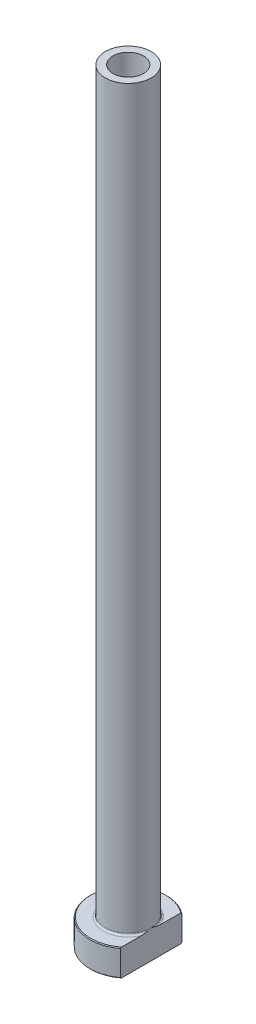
ISO-10303-21;
HEADER;
FILE_DESCRIPTION(('STEP AP214'),'2;1');
FILE_NAME('part.step','',(''),(''),'','','');
FILE_SCHEMA(('AUTOMOTIVE_DESIGN { 1 0 10303 214 1 1 1 1 }'));
ENDSEC;
DATA;
#1=APPLICATION_CONTEXT('core data for automotive mechanical design processes');
#2=APPLICATION_PROTOCOL_DEFINITION('international standard','automotive_design',2000,#1);
#3=PRODUCT_CONTEXT('',#1,'mechanical');
#4=PRODUCT('Part','Part','',(#3));
#5=PRODUCT_RELATED_PRODUCT_CATEGORY('part','',(#4));
#6=PRODUCT_DEFINITION_FORMATION('','',#4);
#7=PRODUCT_DEFINITION_CONTEXT('part definition',#1,'design');
#8=PRODUCT_DEFINITION('design','',#6,#7);
#9=PRODUCT_DEFINITION_SHAPE('','',#8);
#10=(LENGTH_UNIT() NAMED_UNIT(*) SI_UNIT(.MILLI.,.METRE.));
#11=(NAMED_UNIT(*) PLANE_ANGLE_UNIT() SI_UNIT($,.RADIAN.));
#12=(NAMED_UNIT(*) SI_UNIT($,.STERADIAN.) SOLID_ANGLE_UNIT());
#13=UNCERTAINTY_MEASURE_WITH_UNIT(LENGTH_MEASURE(1.E-05),#10,'distance_accuracy_value','');
#14=(GEOMETRIC_REPRESENTATION_CONTEXT(3) GLOBAL_UNCERTAINTY_ASSIGNED_CONTEXT((#13)) GLOBAL_UNIT_ASSIGNED_CONTEXT((#10,
#11,#12)) REPRESENTATION_CONTEXT('',''));
#15=CARTESIAN_POINT('',(0.,0.,0.));
#16=DIRECTION('',(0.,0.,1.));
#17=DIRECTION('',(1.,0.,0.));
#18=AXIS2_PLACEMENT_3D('',#15,#16,#17);
#19=CARTESIAN_POINT('',(0.,92.1876809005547,0.));
#20=DIRECTION('',(0.,1.,0.));
#21=DIRECTION('',(0.,0.,1.));
#22=AXIS2_PLACEMENT_3D('',#19,#20,#21);
#23=CYLINDRICAL_SURFACE('',#22,4.);
#24=CARTESIAN_POINT('',(0.,200.,0.));
#25=DIRECTION('',(0.,1.,0.));
#26=DIRECTION('',(0.,0.,1.));
#27=AXIS2_PLACEMENT_3D('',#24,#25,#26);
#28=CIRCLE('',#27,4.);
#29=CARTESIAN_POINT('',(0.,200.,4.));
#30=VERTEX_POINT('',#29);
#31=EDGE_CURVE('E167',#30,#30,#28,.T.);
#32=ORIENTED_EDGE('',*,*,#31,.T.);
#33=EDGE_LOOP('',(#32));
#34=FACE_BOUND('',#33,.T.);
#35=CARTESIAN_POINT('',(0.,155.,0.));
#36=DIRECTION('',(0.,1.,0.));
#37=DIRECTION('',(0.,0.,1.));
#38=AXIS2_PLACEMENT_3D('',#35,#36,#37);
#39=CIRCLE('',#38,4.);
#40=CARTESIAN_POINT('',(0.,155.,4.));
#41=VERTEX_POINT('',#40);
#42=EDGE_CURVE('E170',#41,#41,#39,.T.);
#43=ORIENTED_EDGE('',*,*,#42,.F.);
#44=EDGE_LOOP('',(#43));
#45=FACE_BOUND('',#44,.T.);
#46=ADVANCED_FACE('F32',(#34,#45),#23,.F.);
#47=CARTESIAN_POINT('',(-4.,200.,0.));
#48=DIRECTION('',(0.,1.,0.));
#49=DIRECTION('',(0.,0.,1.));
#50=AXIS2_PLACEMENT_3D('',#47,#48,#49);
#51=PLANE('',#50);
#52=CARTESIAN_POINT('',(0.,200.,0.));
#53=DIRECTION('',(0.,1.,0.));
#54=DIRECTION('',(0.,0.,1.));
#55=AXIS2_PLACEMENT_3D('',#52,#53,#54);
#56=CIRCLE('',#55,6.00000000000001);
#57=CARTESIAN_POINT('',(0.,200.,6.00000000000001));
#58=VERTEX_POINT('',#57);
#59=EDGE_CURVE('E174',#58,#58,#56,.T.);
#60=ORIENTED_EDGE('',*,*,#59,.T.);
#61=EDGE_LOOP('',(#60));
#62=FACE_BOUND('',#61,.T.);
#63=ORIENTED_EDGE('',*,*,#31,.F.);
#64=EDGE_LOOP('',(#63));
#65=FACE_BOUND('',#64,.T.);
#66=ADVANCED_FACE('F157',(#62,#65),#51,.T.);
#67=CARTESIAN_POINT('',(0.,92.1876809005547,0.));
#68=DIRECTION('',(0.,1.,0.));
#69=DIRECTION('',(0.,0.,1.));
#70=AXIS2_PLACEMENT_3D('',#67,#68,#69);
#71=CYLINDRICAL_SURFACE('',#70,6.);
#72=CARTESIAN_POINT('',(0.,7.50000000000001,0.));
#73=DIRECTION('',(0.,1.,0.));
#74=DIRECTION('',(0.,0.,1.));
#75=AXIS2_PLACEMENT_3D('',#72,#73,#74);
#76=CIRCLE('',#75,6.);
#77=CARTESIAN_POINT('',(6.,7.50000000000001,0.));
#78=VERTEX_POINT('',#77);
#79=EDGE_CURVE('E180',#78,#78,#76,.T.);
#80=ORIENTED_EDGE('',*,*,#79,.T.);
#81=EDGE_LOOP('',(#80));
#82=FACE_BOUND('',#81,.T.);
#83=ORIENTED_EDGE('',*,*,#59,.F.);
#84=EDGE_LOOP('',(#83));
#85=FACE_BOUND('',#84,.T.);
#86=ADVANCED_FACE('F162',(#82,#85),#71,.T.);
#87=CARTESIAN_POINT('',(-5.99999999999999,7.,0.));
#88=DIRECTION('',(0.,1.,0.));
#89=DIRECTION('',(0.,0.,1.));
#90=AXIS2_PLACEMENT_3D('',#87,#88,#89);
#91=PLANE('',#90);
#92=DIRECTION('',(0.,0.,1.));
#93=VECTOR('',#92,1.);
#94=CARTESIAN_POINT('',(6.,7.,0.));
#95=LINE('',#94,#93);
#96=CARTESIAN_POINT('',(6.,7.,-7.74854825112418));
#97=VERTEX_POINT('',#96);
#98=CARTESIAN_POINT('',(6.,7.,-2.50000000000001));
#99=VERTEX_POINT('',#98);
#100=EDGE_CURVE('E54',#97,#99,#95,.T.);
#101=ORIENTED_EDGE('',*,*,#100,.F.);
#102=CARTESIAN_POINT('',(0.,7.,0.));
#103=DIRECTION('',(0.,1.,0.));
#104=DIRECTION('',(0.,0.,1.));
#105=AXIS2_PLACEMENT_3D('',#102,#103,#104);
#106=CIRCLE('',#105,9.79999999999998);
#107=CARTESIAN_POINT('',(5.99999999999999,7.,7.74854825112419));
#108=VERTEX_POINT('',#107);
#109=EDGE_CURVE('E186',#97,#108,#106,.T.);
#110=ORIENTED_EDGE('',*,*,#109,.T.);
#111=CARTESIAN_POINT('',(6.,7.,2.50000000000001));
#112=VERTEX_POINT('',#111);
#113=EDGE_CURVE('E134',#112,#108,#95,.T.);
#114=ORIENTED_EDGE('',*,*,#113,.F.);
#115=CARTESIAN_POINT('',(0.,7.,0.));
#116=DIRECTION('',(0.,1.,0.));
#117=DIRECTION('',(0.,0.,1.));
#118=AXIS2_PLACEMENT_3D('',#115,#116,#117);
#119=CIRCLE('',#118,6.5);
#120=EDGE_CURVE('E183',#112,#99,#119,.F.);
#121=ORIENTED_EDGE('',*,*,#120,.T.);
#122=EDGE_LOOP('',(#101,#110,#114,#121));
#123=FACE_BOUND('',#122,.T.);
#124=ADVANCED_FACE('F197',(#123),#91,.T.);
#125=CARTESIAN_POINT('',(0.,92.1876809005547,0.));
#126=DIRECTION('',(0.,1.,0.));
#127=DIRECTION('',(0.,0.,1.));
#128=AXIS2_PLACEMENT_3D('',#125,#126,#127);
#129=CYLINDRICAL_SURFACE('',#128,9.99999999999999);
#130=DIRECTION('',(0.,-1.,0.));
#131=VECTOR('',#130,1.);
#132=CARTESIAN_POINT('',(5.99999999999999,200.,7.99999999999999));
#133=LINE('',#132,#131);
#134=CARTESIAN_POINT('',(5.99999999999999,6.8,7.99999999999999));
#135=VERTEX_POINT('',#134);
#136=CARTESIAN_POINT('',(5.99999999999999,0.200000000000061,7.99999999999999));
#137=VERTEX_POINT('',#136);
#138=EDGE_CURVE('E82',#135,#137,#133,.T.);
#139=ORIENTED_EDGE('',*,*,#138,.F.);
#140=CARTESIAN_POINT('',(0.,6.8,0.));
#141=DIRECTION('',(0.,1.,0.));
#142=DIRECTION('',(0.,0.,1.));
#143=AXIS2_PLACEMENT_3D('',#140,#141,#142);
#144=CIRCLE('',#143,9.99999999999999);
#145=CARTESIAN_POINT('',(6.,6.8,-7.99999999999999));
#146=VERTEX_POINT('',#145);
#147=EDGE_CURVE('E95',#135,#146,#144,.F.);
#148=ORIENTED_EDGE('',*,*,#147,.T.);
#149=DIRECTION('',(0.,-1.,0.));
#150=VECTOR('',#149,1.);
#151=CARTESIAN_POINT('',(6.,200.,-7.99999999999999));
#152=LINE('',#151,#150);
#153=CARTESIAN_POINT('',(6.,0.200000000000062,-7.99999999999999));
#154=VERTEX_POINT('',#153);
#155=EDGE_CURVE('E192',#146,#154,#152,.T.);
#156=ORIENTED_EDGE('',*,*,#155,.T.);
#157=CARTESIAN_POINT('',(0.,0.200000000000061,0.));
#158=DIRECTION('',(0.,-1.,0.));
#159=DIRECTION('',(0.,0.,-1.));
#160=AXIS2_PLACEMENT_3D('',#157,#158,#159);
#161=CIRCLE('',#160,9.99999999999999);
#162=EDGE_CURVE('E98',#154,#137,#161,.F.);
#163=ORIENTED_EDGE('',*,*,#162,.T.);
#164=EDGE_LOOP('',(#139,#148,#156,#163));
#165=FACE_BOUND('',#164,.T.);
#166=ADVANCED_FACE('F190',(#165),#129,.T.);
#167=CARTESIAN_POINT('',(-9.99999999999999,0.,0.));
#168=DIRECTION('',(0.,-1.,0.));
#169=DIRECTION('',(0.,0.,-1.));
#170=AXIS2_PLACEMENT_3D('',#167,#168,#169);
#171=PLANE('',#170);
#172=CARTESIAN_POINT('',(0.,0.,0.));
#173=DIRECTION('',(0.,-1.,0.));
#174=DIRECTION('',(0.,0.,-1.));
#175=AXIS2_PLACEMENT_3D('',#172,#173,#174);
#176=CIRCLE('',#175,4.75);
#177=CARTESIAN_POINT('',(0.,0.,-4.75));
#178=VERTEX_POINT('',#177);
#179=EDGE_CURVE('E40',#178,#178,#176,.F.);
#180=ORIENTED_EDGE('',*,*,#179,.T.);
#181=EDGE_LOOP('',(#180));
#182=FACE_BOUND('',#181,.T.);
#183=DIRECTION('',(0.,0.,-1.));
#184=VECTOR('',#183,1.);
#185=CARTESIAN_POINT('',(5.99999999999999,0.,7.99999999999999));
#186=LINE('',#185,#184);
#187=CARTESIAN_POINT('',(5.99999999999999,0.,7.74854825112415));
#188=VERTEX_POINT('',#187);
#189=CARTESIAN_POINT('',(6.,0.,-7.74854825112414));
#190=VERTEX_POINT('',#189);
#191=EDGE_CURVE('E47',#188,#190,#186,.T.);
#192=ORIENTED_EDGE('',*,*,#191,.F.);
#193=CARTESIAN_POINT('',(0.,0.,0.));
#194=DIRECTION('',(0.,-1.,0.));
#195=DIRECTION('',(0.,0.,-1.));
#196=AXIS2_PLACEMENT_3D('',#193,#194,#195);
#197=CIRCLE('',#196,9.79999999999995);
#198=EDGE_CURVE('E92',#188,#190,#197,.T.);
#199=ORIENTED_EDGE('',*,*,#198,.T.);
#200=EDGE_LOOP('',(#192,#199));
#201=FACE_BOUND('',#200,.T.);
#202=ADVANCED_FACE('F91',(#182,#201),#171,.T.);
#203=CARTESIAN_POINT('',(0.,92.1876809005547,0.));
#204=DIRECTION('',(0.,1.,0.));
#205=DIRECTION('',(0.,0.,1.));
#206=AXIS2_PLACEMENT_3D('',#203,#204,#205);
#207=CYLINDRICAL_SURFACE('',#206,4.25);
#208=CARTESIAN_POINT('',(0.,0.500000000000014,0.));
#209=DIRECTION('',(0.,-1.,0.));
#210=DIRECTION('',(0.,0.,-1.));
#211=AXIS2_PLACEMENT_3D('',#208,#209,#210);
#212=CIRCLE('',#211,4.25);
#213=CARTESIAN_POINT('',(0.,0.500000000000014,-4.25));
#214=VERTEX_POINT('',#213);
#215=EDGE_CURVE('E11',#214,#214,#212,.T.);
#216=ORIENTED_EDGE('',*,*,#215,.T.);
#217=EDGE_LOOP('',(#216));
#218=FACE_BOUND('',#217,.T.);
#219=CARTESIAN_POINT('',(0.,143.,0.));
#220=DIRECTION('',(0.,1.,0.));
#221=DIRECTION('',(0.,0.,1.));
#222=AXIS2_PLACEMENT_3D('',#219,#220,#221);
#223=CIRCLE('',#222,4.25000000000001);
#224=CARTESIAN_POINT('',(0.,143.,4.25000000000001));
#225=VERTEX_POINT('',#224);
#226=EDGE_CURVE('E172',#225,#225,#223,.T.);
#227=ORIENTED_EDGE('',*,*,#226,.T.);
#228=EDGE_LOOP('',(#227));
#229=FACE_BOUND('',#228,.T.);
#230=ADVANCED_FACE('F215',(#218,#229),#207,.F.);
#231=CARTESIAN_POINT('',(0.,143.,0.));
#232=DIRECTION('',(0.,-1.,0.));
#233=DIRECTION('',(0.,0.,-1.));
#234=AXIS2_PLACEMENT_3D('',#231,#232,#233);
#235=CONICAL_SURFACE('',#234,4.25000000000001,0.0208303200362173);
#236=ORIENTED_EDGE('',*,*,#42,.T.);
#237=EDGE_LOOP('',(#236));
#238=FACE_BOUND('',#237,.T.);
#239=ORIENTED_EDGE('',*,*,#226,.F.);
#240=EDGE_LOOP('',(#239));
#241=FACE_BOUND('',#240,.T.);
#242=ADVANCED_FACE('F111',(#238,#241),#235,.F.);
#243=CARTESIAN_POINT('',(0.,7.50000000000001,0.));
#244=DIRECTION('',(0.,1.,0.));
#245=DIRECTION('',(0.,0.,1.));
#246=AXIS2_PLACEMENT_3D('',#243,#244,#245);
#247=TOROIDAL_SURFACE('',#246,6.5,0.5);
#248=ORIENTED_EDGE('',*,*,#120,.F.);
#249=CARTESIAN_POINT('',(6.,7.50000000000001,0.));
#250=CARTESIAN_POINT('',(6.,7.50000080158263,6.70445881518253E-11));
#251=CARTESIAN_POINT('',(6.,7.50000160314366,2.62462733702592E-07));
#252=CARTESIAN_POINT('',(6.,7.50000311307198,1.01907203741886E-06));
#253=CARTESIAN_POINT('',(6.,7.50000381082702,1.52837948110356E-06));
#254=CARTESIAN_POINT('',(6.,7.50000523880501,2.74467641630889E-06));
#255=CARTESIAN_POINT('',(6.,7.50000595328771,3.4706675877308E-06));
#256=CARTESIAN_POINT('',(6.,7.50000725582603,4.99336222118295E-06));
#257=CARTESIAN_POINT('',(6.,7.50000784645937,5.7880016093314E-06));
#258=CARTESIAN_POINT('',(6.,7.50000997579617,8.79661648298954E-06));
#259=CARTESIAN_POINT('',(6.,7.50001139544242,1.10980680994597E-05));
#260=CARTESIAN_POINT('',(6.,7.50001378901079,1.57116103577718E-05));
#261=CARTESIAN_POINT('',(6.,7.50001478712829,1.8011745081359E-05));
#262=CARTESIAN_POINT('',(6.,7.50001885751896,2.75423852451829E-05));
#263=CARTESIAN_POINT('',(6.,7.50002181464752,3.48285100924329E-05));
#264=CARTESIAN_POINT('',(6.,7.50002628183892,4.87408421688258E-05));
#265=CARTESIAN_POINT('',(6.,7.50002793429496,5.53214404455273E-05));
#266=CARTESIAN_POINT('',(6.,7.50003978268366,0.000103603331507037));
#267=CARTESIAN_POINT('',(6.,7.50004857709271,0.00014557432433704));
#268=CARTESIAN_POINT('',(6.,7.50008704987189,0.000310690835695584));
#269=CARTESIAN_POINT('',(6.,7.5001239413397,0.000432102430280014));
#270=CARTESIAN_POINT('',(5.99999999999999,7.50026686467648,0.000911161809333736));
#271=CARTESIAN_POINT('',(6.,7.50036807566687,0.00126981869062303));
#272=CARTESIAN_POINT('',(6.,7.50077195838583,0.00268961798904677));
#273=CARTESIAN_POINT('',(6.,7.50108058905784,0.00374948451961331));
#274=CARTESIAN_POINT('',(5.99999999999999,7.502363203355,0.00816658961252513));
#275=CARTESIAN_POINT('',(6.,7.50332976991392,0.0115254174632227));
#276=CARTESIAN_POINT('',(6.,7.51709821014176,0.0593544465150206));
#277=CARTESIAN_POINT('',(6.,7.52995465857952,0.103813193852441));
#278=CARTESIAN_POINT('',(5.99999999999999,7.55506029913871,0.190977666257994));
#279=CARTESIAN_POINT('',(6.,7.56731321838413,0.233682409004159));
#280=CARTESIAN_POINT('',(6.,7.59325665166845,0.324512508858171));
#281=CARTESIAN_POINT('',(6.,7.60693346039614,0.372641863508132));
#282=CARTESIAN_POINT('',(6.,7.63422038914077,0.469489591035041));
#283=CARTESIAN_POINT('',(6.,7.64782813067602,0.518208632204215));
#284=CARTESIAN_POINT('',(6.,7.68043734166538,0.636338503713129));
#285=CARTESIAN_POINT('',(6.,7.69928754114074,0.705791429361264));
#286=CARTESIAN_POINT('',(6.,7.73566887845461,0.843102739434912));
#287=CARTESIAN_POINT('',(6.,7.75322160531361,0.910955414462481));
#288=CARTESIAN_POINT('',(6.,7.80024878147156,1.09857433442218));
#289=CARTESIAN_POINT('',(6.,7.82864900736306,1.21861610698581));
#290=CARTESIAN_POINT('',(6.,7.88105633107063,1.46081534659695));
#291=CARTESIAN_POINT('',(6.,7.90502088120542,1.58298212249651));
#292=CARTESIAN_POINT('',(6.,7.94810499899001,1.83866408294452));
#293=CARTESIAN_POINT('',(6.,7.96665856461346,1.97228081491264));
#294=CARTESIAN_POINT('',(6.,7.98621697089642,2.17329578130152));
#295=CARTESIAN_POINT('',(6.,7.991356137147,2.24029152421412));
#296=CARTESIAN_POINT('',(6.,7.99832928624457,2.37444824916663));
#297=CARTESIAN_POINT('',(6.,8.00016429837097,2.44160917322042));
#298=CARTESIAN_POINT('',(6.,7.99984674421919,2.562986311));
#299=CARTESIAN_POINT('',(6.,7.99839439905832,2.61720324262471));
#300=CARTESIAN_POINT('',(6.,7.99236557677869,2.72552036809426));
#301=CARTESIAN_POINT('',(6.,7.98778645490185,2.77962042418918));
#302=CARTESIAN_POINT('',(6.,7.97492915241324,2.88664710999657));
#303=CARTESIAN_POINT('',(6.,7.96670262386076,2.93957965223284));
#304=CARTESIAN_POINT('',(6.,7.9457025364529,3.04448333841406));
#305=CARTESIAN_POINT('',(6.,7.93293488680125,3.09645563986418));
#306=CARTESIAN_POINT('',(6.,7.90135968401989,3.19943606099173));
#307=CARTESIAN_POINT('',(6.,7.8824717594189,3.25042120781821));
#308=CARTESIAN_POINT('',(6.,7.8481868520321,3.32403783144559));
#309=CARTESIAN_POINT('',(6.,7.83579052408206,3.3480643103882));
#310=CARTESIAN_POINT('',(6.,7.80866016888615,3.39474488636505));
#311=CARTESIAN_POINT('',(6.,7.79392968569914,3.41740099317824));
#312=CARTESIAN_POINT('',(6.,7.76577135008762,3.45524173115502));
#313=CARTESIAN_POINT('',(6.,7.75294719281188,3.47087266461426));
#314=CARTESIAN_POINT('',(6.,7.72556313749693,3.50058040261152));
#315=CARTESIAN_POINT('',(6.,7.71100204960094,3.51465612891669));
#316=CARTESIAN_POINT('',(6.,7.67984897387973,3.54077006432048));
#317=CARTESIAN_POINT('',(6.,7.66323651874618,3.55278430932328));
#318=CARTESIAN_POINT('',(6.,7.62815222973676,3.57370259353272));
#319=CARTESIAN_POINT('',(6.,7.60968501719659,3.58261412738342));
#320=CARTESIAN_POINT('',(6.,7.57639898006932,3.59454653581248));
#321=CARTESIAN_POINT('',(6.,7.5619167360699,3.59850385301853));
#322=CARTESIAN_POINT('',(6.,7.53249228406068,3.60392336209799));
#323=CARTESIAN_POINT('',(6.,7.51755044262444,3.60538749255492));
#324=CARTESIAN_POINT('',(6.,7.48761833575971,3.60568912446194));
#325=CARTESIAN_POINT('',(6.,7.47262803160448,3.60452285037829));
#326=CARTESIAN_POINT('',(6.,7.44306278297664,3.59966500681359));
#327=CARTESIAN_POINT('',(6.,7.42848812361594,3.59597174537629));
#328=CARTESIAN_POINT('',(6.,7.39702156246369,3.58531109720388));
#329=CARTESIAN_POINT('',(6.,7.38031267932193,3.57780732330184));
#330=CARTESIAN_POINT('',(6.,7.34834450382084,3.5601843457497));
#331=CARTESIAN_POINT('',(6.,7.33308764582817,3.5500608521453));
#332=CARTESIAN_POINT('',(6.,7.29715308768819,3.52252389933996));
#333=CARTESIAN_POINT('',(6.,7.27737832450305,3.50394102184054));
#334=CARTESIAN_POINT('',(6.,7.24088410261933,3.4639950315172));
#335=CARTESIAN_POINT('',(6.,7.22417302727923,3.44262455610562));
#336=CARTESIAN_POINT('',(6.,7.18148338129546,3.38088102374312));
#337=CARTESIAN_POINT('',(6.,7.1583178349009,3.33858120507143));
#338=CARTESIAN_POINT('',(6.,7.1182274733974,3.25128083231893));
#339=CARTESIAN_POINT('',(6.,7.10130560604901,3.20627901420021));
#340=CARTESIAN_POINT('',(6.,7.07193388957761,3.11375892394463));
#341=CARTESIAN_POINT('',(6.,7.05959256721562,3.0662068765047));
#342=CARTESIAN_POINT('',(6.,7.03888782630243,2.97022063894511));
#343=CARTESIAN_POINT('',(6.,7.03052890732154,2.92178551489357));
#344=CARTESIAN_POINT('',(6.,7.01697563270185,2.82374574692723));
#345=CARTESIAN_POINT('',(6.,7.01183067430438,2.77413446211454));
#346=CARTESIAN_POINT('',(6.,7.00435015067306,2.67475263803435));
#347=CARTESIAN_POINT('',(6.,7.00201229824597,2.62498226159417));
#348=CARTESIAN_POINT('',(6.,6.9989719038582,2.49377014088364));
#349=CARTESIAN_POINT('',(6.,7.00025005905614,2.41228296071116));
#350=CARTESIAN_POINT('',(6.,7.00775652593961,2.24952135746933));
#351=CARTESIAN_POINT('',(6.,7.01398784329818,2.16824709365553));
#352=CARTESIAN_POINT('',(6.,7.03045087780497,2.00575531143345));
#353=CARTESIAN_POINT('',(6.,7.04070001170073,1.92453960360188));
#354=CARTESIAN_POINT('',(6.,7.0644277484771,1.76257601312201));
#355=CARTESIAN_POINT('',(6.,7.07790697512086,1.68182822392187));
#356=CARTESIAN_POINT('',(6.,7.11973611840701,1.45394312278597));
#357=CARTESIAN_POINT('',(6.,7.1511384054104,1.3073698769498));
#358=CARTESIAN_POINT('',(6.,7.21927147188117,1.01717316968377));
#359=CARTESIAN_POINT('',(6.,7.25594155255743,0.873534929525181));
#360=CARTESIAN_POINT('',(6.,7.30765759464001,0.680321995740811));
#361=CARTESIAN_POINT('',(6.,7.32124979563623,0.630351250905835));
#362=CARTESIAN_POINT('',(6.,7.34913735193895,0.529103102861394));
#363=CARTESIAN_POINT('',(6.,7.36344174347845,0.477828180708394));
#364=CARTESIAN_POINT('',(6.,7.38809313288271,0.390268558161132));
#365=CARTESIAN_POINT('',(6.,7.39837954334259,0.353966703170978));
#366=CARTESIAN_POINT('',(6.,7.4189344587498,0.281778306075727));
#367=CARTESIAN_POINT('',(6.,7.42920197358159,0.245891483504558));
#368=CARTESIAN_POINT('',(6.,7.44864004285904,0.178137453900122));
#369=CARTESIAN_POINT('',(5.99999999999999,7.4578051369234,0.146268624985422));
#370=CARTESIAN_POINT('',(6.,7.47656016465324,0.0812304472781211));
#371=CARTESIAN_POINT('',(6.,7.48615204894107,0.0480615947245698));
#372=CARTESIAN_POINT('',(6.,7.49666961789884,0.0115277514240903));
#373=CARTESIAN_POINT('',(5.99999999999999,7.49763547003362,0.00817123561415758));
#374=CARTESIAN_POINT('',(6.,7.49891791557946,0.00375466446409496));
#375=CARTESIAN_POINT('',(6.,7.49922706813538,0.00269301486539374));
#376=CARTESIAN_POINT('',(6.,7.49963158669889,0.00127098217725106));
#377=CARTESIAN_POINT('',(5.99999999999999,7.49973292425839,0.000911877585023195));
#378=CARTESIAN_POINT('',(6.,7.49987600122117,0.000432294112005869));
#379=CARTESIAN_POINT('',(6.,7.49991291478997,0.000310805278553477));
#380=CARTESIAN_POINT('',(6.,7.49995140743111,0.000145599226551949));
#381=CARTESIAN_POINT('',(6.,7.49996020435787,0.000103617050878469));
#382=CARTESIAN_POINT('',(6.,7.49997205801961,5.53238232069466E-05));
#383=CARTESIAN_POINT('',(6.,7.49997371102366,4.87425709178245E-05));
#384=CARTESIAN_POINT('',(6.,7.49997817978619,3.48289268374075E-05));
#385=CARTESIAN_POINT('',(6.,7.4999811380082,2.75421782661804E-05));
#386=CARTESIAN_POINT('',(6.,7.49998520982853,1.80109014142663E-05));
#387=CARTESIAN_POINT('',(6.,7.49998620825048,1.57107175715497E-05));
#388=CARTESIAN_POINT('',(6.,7.49998860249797,1.10971299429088E-05));
#389=CARTESIAN_POINT('',(6.,7.4999900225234,8.79568760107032E-06));
#390=CARTESIAN_POINT('',(6.,7.49999215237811,5.78714760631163E-06));
#391=CARTESIAN_POINT('',(6.,7.49999274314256,4.99254413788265E-06));
#392=CARTESIAN_POINT('',(6.,7.49999404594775,3.4699450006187E-06));
#393=CARTESIAN_POINT('',(6.,7.49999476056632,2.74401406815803E-06));
#394=CARTESIAN_POINT('',(6.,7.49999618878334,1.52786009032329E-06));
#395=CARTESIAN_POINT('',(6.,7.49999688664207,1.01863055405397E-06));
#396=CARTESIAN_POINT('',(6.,7.49999839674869,2.62215650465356E-07));
#397=CARTESIAN_POINT('',(6.,7.49999919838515,-6.70459830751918E-11));
#398=CARTESIAN_POINT('',(6.,7.50000000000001,0.));
#399=B_SPLINE_CURVE_WITH_KNOTS('',3,(#249,#250,#251,#252,#253,#254,#255,#256,#257,#258,#259,
#260,#261,#262,#263,#264,#265,#266,#267,#268,#269,#270,#271,#272,#273,#274,#275,#276,#277,#278,
#279,#280,#281,#282,#283,#284,#285,#286,#287,#288,#289,#290,#291,#292,#293,#294,#295,#296,#297,
#298,#299,#300,#301,#302,#303,#304,#305,#306,#307,#308,#309,#310,#311,#312,#313,#314,#315,#316,
#317,#318,#319,#320,#321,#322,#323,#324,#325,#326,#327,#328,#329,#330,#331,#332,#333,#334,#335,
#336,#337,#338,#339,#340,#341,#342,#343,#344,#345,#346,#347,#348,#349,#350,#351,#352,#353,#354,
#355,#356,#357,#358,#359,#360,#361,#362,#363,#364,#365,#366,#367,#368,#369,#370,#371,#372,#373,
#374,#375,#376,#377,#378,#379,#380,#381,#382,#383,#384,#385,#386,#387,#388,#389,#390,#391,#392,
#393,#394,#395,#396,#397,#398),.UNSPECIFIED.,.T.,.F.,(4,2,2,2,2,2,2,2,2,2,2,2,2,2,2,2,2,2,2,2,2,
2,2,2,2,2,2,2,2,2,2,2,2,2,2,2,2,2,2,2,2,2,2,2,2,2,2,2,2,2,2,2,2,2,2,2,2,2,2,2,2,2,2,2,2,2,2,2,2,
2,2,2,2,2,4),(0.,2.41532870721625E-06,5.0016182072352E-06,8.04116003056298E-06,
1.10092318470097E-05,1.90889747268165E-05,2.66047381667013E-05,5.01454087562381E-05,
7.04740035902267E-05,0.000199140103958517,0.00057937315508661,0.00169781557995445,
0.00500893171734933,0.0154949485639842,0.154330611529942,0.287615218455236,0.437719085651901,
0.589470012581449,0.805361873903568,1.01561737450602,1.3856140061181,1.75899405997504,
2.16331287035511,2.36482907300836,2.56628249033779,2.72891861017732,2.89169246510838,
3.05223140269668,3.21256219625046,3.3750901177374,3.45609970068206,3.53698744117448,
3.59753760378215,3.65812948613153,3.7193839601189,3.78048942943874,3.82533702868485,
3.87014974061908,3.91502681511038,3.95993396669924,4.01458097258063,4.06931803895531,
4.15026803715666,4.2314363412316,4.37530581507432,4.51924312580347,4.66640085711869,
4.81372446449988,4.96325999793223,5.11267360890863,5.35695170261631,5.60137814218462,
5.84687607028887,6.09242144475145,6.54191534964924,6.986593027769,7.14195169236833,
7.30164895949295,7.41484221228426,7.52682205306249,7.62630458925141,7.72988447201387,
7.74036324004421,7.74367992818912,7.74479976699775,7.7451802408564,7.74530894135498,
7.74532927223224,7.74535281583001,7.74536033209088,7.74536841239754,7.7453713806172,
7.74537442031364,7.7453770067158,7.74537942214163),.UNSPECIFIED.);
#400=EDGE_CURVE('E126',#112,#78,#399,.T.);
#401=ORIENTED_EDGE('',*,*,#400,.T.);
#402=ORIENTED_EDGE('',*,*,#79,.F.);
#403=CARTESIAN_POINT('',(6.,7.50000000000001,0.));
#404=CARTESIAN_POINT('',(6.,7.49999919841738,-6.70433830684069E-11));
#405=CARTESIAN_POINT('',(6.,7.49999839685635,-2.62462732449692E-07));
#406=CARTESIAN_POINT('',(6.,7.49999688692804,-1.01907203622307E-06));
#407=CARTESIAN_POINT('',(6.,7.499996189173,-1.52837947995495E-06));
#408=CARTESIAN_POINT('',(6.,7.499994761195,-2.74467641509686E-06));
#409=CARTESIAN_POINT('',(6.,7.4999940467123,-3.47066758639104E-06));
#410=CARTESIAN_POINT('',(6.,7.49999274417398,-4.99336221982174E-06));
#411=CARTESIAN_POINT('',(6.,7.49999215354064,-5.78800160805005E-06));
#412=CARTESIAN_POINT('',(6.,7.49999002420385,-8.79661648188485E-06));
#413=CARTESIAN_POINT('',(6.,7.49998860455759,-1.10980680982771E-05));
#414=CARTESIAN_POINT('',(6.,7.49998621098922,-1.57116103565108E-05));
#415=CARTESIAN_POINT('',(6.,7.49998521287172,-1.80117450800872E-05));
#416=CARTESIAN_POINT('',(6.,7.49998114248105,-2.75423852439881E-05));
#417=CARTESIAN_POINT('',(6.,7.4999781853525,-3.48285100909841E-05));
#418=CARTESIAN_POINT('',(6.,7.49997371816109,-4.87408421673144E-05));
#419=CARTESIAN_POINT('',(6.,7.49997206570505,-5.53214404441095E-05));
#420=CARTESIAN_POINT('',(6.,7.49996021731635,-0.000103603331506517));
#421=CARTESIAN_POINT('',(6.,7.4999514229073,-0.000145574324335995));
#422=CARTESIAN_POINT('',(5.99999999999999,7.49991295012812,-0.000310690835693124));
#423=CARTESIAN_POINT('',(5.99999999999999,7.49987605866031,-0.000432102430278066));
#424=CARTESIAN_POINT('',(6.,7.49973313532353,-0.000911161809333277));
#425=CARTESIAN_POINT('',(6.,7.49963192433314,-0.00126981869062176));
#426=CARTESIAN_POINT('',(5.99999999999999,7.49922804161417,-0.00268961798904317));
#427=CARTESIAN_POINT('',(5.99999999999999,7.49891941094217,-0.00374948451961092));
#428=CARTESIAN_POINT('',(6.00000000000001,7.49763679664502,-0.00816658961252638));
#429=CARTESIAN_POINT('',(6.,7.4966702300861,-0.0115254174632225));
#430=CARTESIAN_POINT('',(5.99999999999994,7.4829017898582,-0.0593544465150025));
#431=CARTESIAN_POINT('',(5.99999999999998,7.47004534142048,-0.103813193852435));
#432=CARTESIAN_POINT('',(6.00000000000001,7.44493970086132,-0.190977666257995));
#433=CARTESIAN_POINT('',(6.,7.43268678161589,-0.233682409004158));
#434=CARTESIAN_POINT('',(5.99999999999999,7.40674334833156,-0.324512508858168));
#435=CARTESIAN_POINT('',(5.99999999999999,7.39306653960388,-0.372641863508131));
#436=CARTESIAN_POINT('',(6.,7.36577961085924,-0.46948959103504));
#437=CARTESIAN_POINT('',(6.,7.352171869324,-0.518208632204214));
#438=CARTESIAN_POINT('',(5.99999999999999,7.31956265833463,-0.636338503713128));
#439=CARTESIAN_POINT('',(6.,7.30071245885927,-0.705791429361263));
#440=CARTESIAN_POINT('',(6.,7.2643311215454,-0.843102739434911));
#441=CARTESIAN_POINT('',(6.,7.24677839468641,-0.91095541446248));
#442=CARTESIAN_POINT('',(6.,7.19975121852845,-1.09857433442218));
#443=CARTESIAN_POINT('',(6.,7.17135099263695,-1.21861610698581));
#444=CARTESIAN_POINT('',(6.,7.11894366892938,-1.46081534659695));
#445=CARTESIAN_POINT('',(6.,7.09497911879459,-1.58298212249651));
#446=CARTESIAN_POINT('',(6.,7.05189500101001,-1.83866408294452));
#447=CARTESIAN_POINT('',(6.,7.03334143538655,-1.97228081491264));
#448=CARTESIAN_POINT('',(6.,7.01378302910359,-2.17329578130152));
#449=CARTESIAN_POINT('',(6.,7.00864386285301,-2.24029152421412));
#450=CARTESIAN_POINT('',(6.,7.00167071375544,-2.37444824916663));
#451=CARTESIAN_POINT('',(6.,6.99983570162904,-2.44160917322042));
#452=CARTESIAN_POINT('',(6.,7.00015325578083,-2.562986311));
#453=CARTESIAN_POINT('',(6.,7.00160560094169,-2.61720324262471));
#454=CARTESIAN_POINT('',(6.,7.00763442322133,-2.72552036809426));
#455=CARTESIAN_POINT('',(6.,7.01221354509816,-2.77962042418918));
#456=CARTESIAN_POINT('',(6.,7.02507084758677,-2.88664710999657));
#457=CARTESIAN_POINT('',(6.,7.03329737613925,-2.93957965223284));
#458=CARTESIAN_POINT('',(6.,7.05429746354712,-3.04448333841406));
#459=CARTESIAN_POINT('',(6.,7.06706511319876,-3.09645563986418));
#460=CARTESIAN_POINT('',(6.,7.09864031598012,-3.19943606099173));
#461=CARTESIAN_POINT('',(6.,7.11752824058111,-3.25042120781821));
#462=CARTESIAN_POINT('',(6.,7.15181314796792,-3.32403783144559));
#463=CARTESIAN_POINT('',(6.,7.16420947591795,-3.34806431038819));
#464=CARTESIAN_POINT('',(6.,7.19133983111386,-3.39474488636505));
#465=CARTESIAN_POINT('',(6.,7.20607031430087,-3.41740099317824));
#466=CARTESIAN_POINT('',(6.,7.23422864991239,-3.45524173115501));
#467=CARTESIAN_POINT('',(6.,7.24705280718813,-3.47087266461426));
#468=CARTESIAN_POINT('',(6.,7.27443686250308,-3.50058040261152));
#469=CARTESIAN_POINT('',(6.,7.28899795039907,-3.51465612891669));
#470=CARTESIAN_POINT('',(6.,7.32015102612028,-3.54077006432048));
#471=CARTESIAN_POINT('',(6.,7.33676348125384,-3.55278430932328));
#472=CARTESIAN_POINT('',(6.,7.37184777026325,-3.57370259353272));
#473=CARTESIAN_POINT('',(6.,7.39031498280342,-3.58261412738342));
#474=CARTESIAN_POINT('',(6.,7.42360101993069,-3.59454653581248));
#475=CARTESIAN_POINT('',(6.,7.43808326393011,-3.59850385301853));
#476=CARTESIAN_POINT('',(6.,7.46750771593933,-3.60392336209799));
#477=CARTESIAN_POINT('',(6.,7.48244955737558,-3.60538749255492));
#478=CARTESIAN_POINT('',(6.,7.5123816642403,-3.60568912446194));
#479=CARTESIAN_POINT('',(6.,7.52737196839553,-3.60452285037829));
#480=CARTESIAN_POINT('',(6.,7.55693721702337,-3.59966500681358));
#481=CARTESIAN_POINT('',(6.,7.57151187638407,-3.59597174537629));
#482=CARTESIAN_POINT('',(6.,7.60297843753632,-3.58531109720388));
#483=CARTESIAN_POINT('',(6.,7.61968732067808,-3.57780732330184));
#484=CARTESIAN_POINT('',(6.,7.65165549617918,-3.5601843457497));
#485=CARTESIAN_POINT('',(6.,7.66691235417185,-3.55006085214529));
#486=CARTESIAN_POINT('',(6.,7.70284691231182,-3.52252389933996));
#487=CARTESIAN_POINT('',(6.,7.72262167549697,-3.50394102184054));
#488=CARTESIAN_POINT('',(6.,7.75911589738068,-3.4639950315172));
#489=CARTESIAN_POINT('',(6.,7.77582697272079,-3.44262455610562));
#490=CARTESIAN_POINT('',(6.,7.81851661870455,-3.38088102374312));
#491=CARTESIAN_POINT('',(6.,7.84168216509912,-3.33858120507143));
#492=CARTESIAN_POINT('',(6.,7.88177252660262,-3.25128083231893));
#493=CARTESIAN_POINT('',(6.,7.89869439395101,-3.20627901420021));
#494=CARTESIAN_POINT('',(6.,7.9280661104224,-3.11375892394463));
#495=CARTESIAN_POINT('',(6.,7.9404074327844,-3.0662068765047));
#496=CARTESIAN_POINT('',(6.,7.96111217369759,-2.97022063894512));
#497=CARTESIAN_POINT('',(6.,7.96947109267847,-2.92178551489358));
#498=CARTESIAN_POINT('',(6.,7.98302436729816,-2.82374574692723));
#499=CARTESIAN_POINT('',(6.,7.98816932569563,-2.77413446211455));
#500=CARTESIAN_POINT('',(6.,7.99564984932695,-2.67475263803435));
#501=CARTESIAN_POINT('',(6.,7.99798770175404,-2.62498226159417));
#502=CARTESIAN_POINT('',(6.,8.00102809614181,-2.49377014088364));
#503=CARTESIAN_POINT('',(6.,7.99974994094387,-2.41228296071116));
#504=CARTESIAN_POINT('',(6.,7.9922434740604,-2.24952135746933));
#505=CARTESIAN_POINT('',(6.,7.98601215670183,-2.16824709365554));
#506=CARTESIAN_POINT('',(6.,7.96954912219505,-2.00575531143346));
#507=CARTESIAN_POINT('',(6.,7.95929998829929,-1.92453960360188));
#508=CARTESIAN_POINT('',(6.,7.93557225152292,-1.76257601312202));
#509=CARTESIAN_POINT('',(6.,7.92209302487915,-1.68182822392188));
#510=CARTESIAN_POINT('',(6.,7.88026388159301,-1.45394312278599));
#511=CARTESIAN_POINT('',(6.,7.84886159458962,-1.30736987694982));
#512=CARTESIAN_POINT('',(6.,7.78072852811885,-1.01717316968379));
#513=CARTESIAN_POINT('',(6.,7.74405844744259,-0.8735349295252));
#514=CARTESIAN_POINT('',(6.,7.69234240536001,-0.680321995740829));
#515=CARTESIAN_POINT('',(6.,7.67875020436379,-0.63035125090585));
#516=CARTESIAN_POINT('',(6.,7.65086264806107,-0.529103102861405));
#517=CARTESIAN_POINT('',(6.,7.63655825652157,-0.477828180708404));
#518=CARTESIAN_POINT('',(6.,7.6119068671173,-0.39026855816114));
#519=CARTESIAN_POINT('',(6.,7.60162045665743,-0.353966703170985));
#520=CARTESIAN_POINT('',(6.,7.58106554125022,-0.281778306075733));
#521=CARTESIAN_POINT('',(6.,7.57079802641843,-0.245891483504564));
#522=CARTESIAN_POINT('',(6.,7.55135995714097,-0.178137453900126));
#523=CARTESIAN_POINT('',(5.99999999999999,7.54219486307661,-0.146268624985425));
#524=CARTESIAN_POINT('',(6.,7.52343983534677,-0.0812304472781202));
#525=CARTESIAN_POINT('',(6.,7.51384795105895,-0.0480615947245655));
#526=CARTESIAN_POINT('',(6.,7.50333038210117,-0.0115277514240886));
#527=CARTESIAN_POINT('',(5.99999999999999,7.50236452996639,-0.00817123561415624));
#528=CARTESIAN_POINT('',(6.,7.50108208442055,-0.00375466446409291));
#529=CARTESIAN_POINT('',(6.,7.50077293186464,-0.00269301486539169));
#530=CARTESIAN_POINT('',(6.,7.50036841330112,-0.00127098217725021));
#531=CARTESIAN_POINT('',(5.99999999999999,7.50026707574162,-0.000911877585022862));
#532=CARTESIAN_POINT('',(6.,7.50012399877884,-0.000432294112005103));
#533=CARTESIAN_POINT('',(6.,7.50008708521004,-0.00031080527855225));
#534=CARTESIAN_POINT('',(6.,7.5000485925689,-0.000145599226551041));
#535=CARTESIAN_POINT('',(6.,7.50003979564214,-0.000103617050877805));
#536=CARTESIAN_POINT('',(6.,7.5000279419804,-5.53238232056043E-05));
#537=CARTESIAN_POINT('',(6.,7.50002628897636,-4.87425709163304E-05));
#538=CARTESIAN_POINT('',(6.,7.50002182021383,-3.48289268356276E-05));
#539=CARTESIAN_POINT('',(6.,7.50001886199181,-2.75421782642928E-05));
#540=CARTESIAN_POINT('',(6.,7.50001479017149,-1.80109014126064E-05));
#541=CARTESIAN_POINT('',(6.,7.50001379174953,-1.57107175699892E-05));
#542=CARTESIAN_POINT('',(6.,7.50001139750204,-1.10971299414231E-05));
#543=CARTESIAN_POINT('',(6.,7.50000997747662,-8.79568759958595E-06));
#544=CARTESIAN_POINT('',(6.,7.5000078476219,-5.78714760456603E-06));
#545=CARTESIAN_POINT('',(6.,7.50000725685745,-4.99254413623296E-06));
#546=CARTESIAN_POINT('',(6.,7.50000595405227,-3.46994499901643E-06));
#547=CARTESIAN_POINT('',(6.,7.5000052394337,-2.74401406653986E-06));
#548=CARTESIAN_POINT('',(6.,7.50000381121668,-1.52786008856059E-06));
#549=CARTESIAN_POINT('',(6.,7.50000311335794,-1.0186305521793E-06));
#550=CARTESIAN_POINT('',(6.,7.50000160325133,-2.62215648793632E-07));
#551=CARTESIAN_POINT('',(6.,7.50000080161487,6.70473800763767E-11));
#552=CARTESIAN_POINT('',(6.,7.50000000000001,0.));
#553=B_SPLINE_CURVE_WITH_KNOTS('',3,(#403,#404,#405,#406,#407,#408,#409,#410,#411,#412,#413,
#414,#415,#416,#417,#418,#419,#420,#421,#422,#423,#424,#425,#426,#427,#428,#429,#430,#431,#432,
#433,#434,#435,#436,#437,#438,#439,#440,#441,#442,#443,#444,#445,#446,#447,#448,#449,#450,#451,
#452,#453,#454,#455,#456,#457,#458,#459,#460,#461,#462,#463,#464,#465,#466,#467,#468,#469,#470,
#471,#472,#473,#474,#475,#476,#477,#478,#479,#480,#481,#482,#483,#484,#485,#486,#487,#488,#489,
#490,#491,#492,#493,#494,#495,#496,#497,#498,#499,#500,#501,#502,#503,#504,#505,#506,#507,#508,
#509,#510,#511,#512,#513,#514,#515,#516,#517,#518,#519,#520,#521,#522,#523,#524,#525,#526,#527,
#528,#529,#530,#531,#532,#533,#534,#535,#536,#537,#538,#539,#540,#541,#542,#543,#544,#545,#546,
#547,#548,#549,#550,#551,#552),.UNSPECIFIED.,.T.,.F.,(4,2,2,2,2,2,2,2,2,2,2,2,2,2,2,2,2,2,2,2,2,
2,2,2,2,2,2,2,2,2,2,2,2,2,2,2,2,2,2,2,2,2,2,2,2,2,2,2,2,2,2,2,2,2,2,2,2,2,2,2,2,2,2,2,2,2,2,2,2,
2,2,2,2,2,4),(0.,2.41532870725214E-06,5.00161820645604E-06,8.04116003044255E-06,
1.10092318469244E-05,1.90889747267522E-05,2.66047381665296E-05,5.01454087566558E-05,
7.04740035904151E-05,0.000199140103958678,0.0005793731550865,0.00169781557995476,
0.00500893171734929,0.0154949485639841,0.15433061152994,0.287615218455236,0.437719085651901,
0.58947001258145,0.805361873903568,1.01561737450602,1.3856140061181,1.75899405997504,
2.16331287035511,2.36482907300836,2.56628249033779,2.72891861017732,2.89169246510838,
3.05223140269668,3.21256219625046,3.3750901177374,3.45609970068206,3.53698744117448,
3.59753760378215,3.65812948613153,3.7193839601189,3.78048942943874,3.82533702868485,
3.87014974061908,3.91502681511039,3.95993396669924,4.01458097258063,4.06931803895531,
4.15026803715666,4.23143634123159,4.37530581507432,4.51924312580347,4.66640085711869,
4.81372446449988,4.96325999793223,5.11267360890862,5.35695170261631,5.60137814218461,
5.84687607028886,6.09242144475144,6.54191534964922,6.98659302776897,7.14195169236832,
7.30164895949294,7.41484221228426,7.52682205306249,7.62630458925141,7.72988447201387,
7.74036324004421,7.74367992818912,7.74479976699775,7.7451802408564,7.74530894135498,
7.74532927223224,7.74535281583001,7.74536033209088,7.74536841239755,7.7453713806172,
7.74537442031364,7.7453770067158,7.74537942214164),.UNSPECIFIED.);
#554=EDGE_CURVE('E135',#78,#99,#553,.T.);
#555=ORIENTED_EDGE('',*,*,#554,.T.);
#556=EDGE_LOOP('',(#248,#401,#402,#555));
#557=FACE_BOUND('',#556,.T.);
#558=ADVANCED_FACE('F141',(#557),#247,.F.);
#559=CARTESIAN_POINT('',(0.,7.00000000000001,0.));
#560=DIRECTION('',(0.,-1.,0.));
#561=DIRECTION('',(0.,0.,-1.));
#562=AXIS2_PLACEMENT_3D('',#559,#560,#561);
#563=CONICAL_SURFACE('',#562,9.79999999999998,0.785398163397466);
#564=CARTESIAN_POINT('',(6.,-1.79552203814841,-17.6009499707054));
#565=CARTESIAN_POINT('',(6.,-1.52401937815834,-17.3141017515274));
#566=CARTESIAN_POINT('',(6.,-1.25287676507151,-17.0269132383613));
#567=CARTESIAN_POINT('',(6.,-0.711434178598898,-16.4517398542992));
#568=CARTESIAN_POINT('',(6.,-0.441134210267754,-16.1637549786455));
#569=CARTESIAN_POINT('',(6.,0.368940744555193,-15.2977662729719));
#570=CARTESIAN_POINT('',(6.,0.90725856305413,-14.718395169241));
#571=CARTESIAN_POINT('',(6.,1.72215780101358,-13.8331216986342));
#572=CARTESIAN_POINT('',(6.,2.00071138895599,-13.5290344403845));
#573=CARTESIAN_POINT('',(6.,2.55603074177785,-12.9192325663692));
#574=CARTESIAN_POINT('',(6.,2.83279651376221,-12.6135179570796));
#575=CARTESIAN_POINT('',(6.,3.38385174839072,-12.0004608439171));
#576=CARTESIAN_POINT('',(6.,3.65814356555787,-11.6931204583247));
#577=CARTESIAN_POINT('',(6.,4.20403297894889,-11.0760595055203));
#578=CARTESIAN_POINT('',(6.,4.47563060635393,-10.7663389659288));
#579=CARTESIAN_POINT('',(6.,5.01505245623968,-10.1444038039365));
#580=CARTESIAN_POINT('',(6.,5.28288153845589,-9.83219340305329));
#581=CARTESIAN_POINT('',(6.,5.8142293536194,-9.20408822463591));
#582=CARTESIAN_POINT('',(6.,6.07774785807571,-8.88819325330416));
#583=CARTESIAN_POINT('',(6.,6.60003626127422,-8.25062578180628));
#584=CARTESIAN_POINT('',(6.,6.85878611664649,-7.92893682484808));
#585=CARTESIAN_POINT('',(6.,7.36859509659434,-7.27955943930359));
#586=CARTESIAN_POINT('',(6.,7.61965542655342,-6.95187196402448));
#587=CARTESIAN_POINT('',(6.,7.98576066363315,-6.45775713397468));
#588=CARTESIAN_POINT('',(6.,8.10486172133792,-6.2943343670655));
#589=CARTESIAN_POINT('',(6.,8.34000134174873,-5.9653036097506));
#590=CARTESIAN_POINT('',(6.,8.45604001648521,-5.79969569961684));
#591=CARTESIAN_POINT('',(6.,8.68455547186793,-5.46582678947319));
#592=CARTESIAN_POINT('',(6.,8.79702913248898,-5.29756364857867));
#593=CARTESIAN_POINT('',(6.,9.01753757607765,-4.95816178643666));
#594=CARTESIAN_POINT('',(6.,9.12557269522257,-4.7870232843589));
#595=CARTESIAN_POINT('',(6.,9.33560820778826,-4.44248614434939));
#596=CARTESIAN_POINT('',(6.,9.4376411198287,-4.26910741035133));
#597=CARTESIAN_POINT('',(6.,9.63518094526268,-3.91862113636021));
#598=CARTESIAN_POINT('',(6.,9.73068703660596,-3.74151313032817));
#599=CARTESIAN_POINT('',(6.,9.91348788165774,-3.38344678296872));
#600=CARTESIAN_POINT('',(6.,10.0007956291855,-3.20249511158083));
#601=CARTESIAN_POINT('',(6.,10.1654678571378,-2.8361534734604));
#602=CARTESIAN_POINT('',(6.,10.2428364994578,-2.6507654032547));
#603=CARTESIAN_POINT('',(6.,10.3476493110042,-2.3747623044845));
#604=CARTESIAN_POINT('',(6.,10.3798377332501,-2.28593872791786));
#605=CARTESIAN_POINT('',(6.,10.4412613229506,-2.10727300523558));
#606=CARTESIAN_POINT('',(6.,10.4704963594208,-2.01743081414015));
#607=CARTESIAN_POINT('',(6.,10.5533861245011,-1.74635894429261));
#608=CARTESIAN_POINT('',(6.,10.6022144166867,-1.5636127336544));
#609=CARTESIAN_POINT('',(6.,10.6846214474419,-1.19573724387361));
#610=CARTESIAN_POINT('',(6.,10.7182826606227,-1.01062662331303));
#611=CARTESIAN_POINT('',(6.,10.7689812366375,-0.638123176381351));
#612=CARTESIAN_POINT('',(6.,10.7860205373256,-0.450730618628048));
#613=CARTESIAN_POINT('',(6.,10.8025183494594,-0.0738640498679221));
#614=CARTESIAN_POINT('',(6.,10.8018548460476,0.11561540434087));
#615=CARTESIAN_POINT('',(6.,10.7826880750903,0.493653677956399));
#616=CARTESIAN_POINT('',(6.,10.7641846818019,0.682212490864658));
#617=CARTESIAN_POINT('',(6.,10.7103251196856,1.0577626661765));
#618=CARTESIAN_POINT('',(6.,10.6748911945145,1.24474270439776));
#619=CARTESIAN_POINT('',(6.,10.5890121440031,1.61520150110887));
#620=CARTESIAN_POINT('',(6.,10.538563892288,1.79867952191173));
#621=CARTESIAN_POINT('',(6.,10.3911282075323,2.26914112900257));
#622=CARTESIAN_POINT('',(6.,10.2842782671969,2.55302531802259));
#623=CARTESIAN_POINT('',(6.,10.0463958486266,3.11045503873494));
#624=CARTESIAN_POINT('',(6.,9.91534345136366,3.38399182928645));
#625=CARTESIAN_POINT('',(6.,9.70492342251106,3.78859721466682));
#626=CARTESIAN_POINT('',(5.99999999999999,9.63209854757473,3.92313856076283));
#627=CARTESIAN_POINT('',(5.99999999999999,9.48259417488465,4.19006838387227));
#628=CARTESIAN_POINT('',(5.99999999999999,9.40591462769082,4.3224568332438));
#629=CARTESIAN_POINT('',(5.99999999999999,9.24930540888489,4.58520549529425));
#630=CARTESIAN_POINT('',(5.99999999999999,9.16937727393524,4.71556662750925));
#631=CARTESIAN_POINT('',(5.99999999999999,9.00669783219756,4.97450350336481));
#632=CARTESIAN_POINT('',(5.99999999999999,8.92394663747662,5.10307931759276));
#633=CARTESIAN_POINT('',(5.99999999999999,8.64351229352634,5.52985219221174));
#634=CARTESIAN_POINT('',(5.99999999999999,8.44039926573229,5.82448590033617));
#635=CARTESIAN_POINT('',(5.99999999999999,8.02460715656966,6.40694921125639));
#636=CARTESIAN_POINT('',(5.99999999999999,7.81192597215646,6.69477729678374));
#637=CARTESIAN_POINT('',(5.99999999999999,7.37931497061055,7.26525171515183));
#638=CARTESIAN_POINT('',(5.99999999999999,7.15937990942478,7.54789405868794));
#639=CARTESIAN_POINT('',(5.99999999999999,6.71413940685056,8.10886295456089));
#640=CARTESIAN_POINT('',(5.99999999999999,6.48883440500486,8.38718985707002));
#641=CARTESIAN_POINT('',(5.99999999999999,6.03331036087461,8.94128328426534));
#642=CARTESIAN_POINT('',(5.99999999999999,5.80307787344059,9.21703873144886));
#643=CARTESIAN_POINT('',(5.99999999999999,5.33927970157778,9.76573512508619));
#644=CARTESIAN_POINT('',(5.99999999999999,5.10571395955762,10.03867602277));
#645=CARTESIAN_POINT('',(5.99999999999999,4.63600560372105,10.5821276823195));
#646=CARTESIAN_POINT('',(5.99999999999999,4.39986411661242,10.8526394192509));
#647=CARTESIAN_POINT('',(5.99999999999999,3.9253962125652,11.391741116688));
#648=CARTESIAN_POINT('',(5.99999999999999,3.68706977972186,11.6603310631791));
#649=CARTESIAN_POINT('',(5.99999999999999,3.01761185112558,12.4097238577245));
#650=CARTESIAN_POINT('',(5.99999999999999,2.58447471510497,12.8887346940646));
#651=CARTESIAN_POINT('',(5.99999999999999,1.71393239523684,13.8429570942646));
#652=CARTESIAN_POINT('',(5.99999999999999,1.27652670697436,14.3181681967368));
#653=CARTESIAN_POINT('',(5.99999999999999,0.401335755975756,15.2626172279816));
#654=CARTESIAN_POINT('',(5.99999999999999,-0.0364292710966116,15.731873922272));
#655=CARTESIAN_POINT('',(5.99999999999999,-0.694863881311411,16.4340144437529));
#656=CARTESIAN_POINT('',(5.99999999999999,-0.914623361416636,16.6677530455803));
#657=CARTESIAN_POINT('',(5.99999999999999,-1.35468319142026,17.1347195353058));
#658=CARTESIAN_POINT('',(5.99999999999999,-1.57498354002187,17.3679474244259));
#659=CARTESIAN_POINT('',(5.99999999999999,-1.79552203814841,17.6009499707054));
#660=B_SPLINE_CURVE_WITH_KNOTS('',3,(#564,#565,#566,#567,#568,#569,#570,#571,#572,#573,#574,
#575,#576,#577,#578,#579,#580,#581,#582,#583,#584,#585,#586,#587,#588,#589,#590,#591,#592,#593,
#594,#595,#596,#597,#598,#599,#600,#601,#602,#603,#604,#605,#606,#607,#608,#609,#610,#611,#612,
#613,#614,#615,#616,#617,#618,#619,#620,#621,#622,#623,#624,#625,#626,#627,#628,#629,#630,#631,
#632,#633,#634,#635,#636,#637,#638,#639,#640,#641,#642,#643,#644,#645,#646,#647,#648,#649,#650,
#651,#652,#653,#654,#655,#656,#657,#658,#659),.UNSPECIFIED.,.F.,.F.,(4,2,2,2,2,2,2,2,2,2,2,2,2,
2,2,2,2,2,2,2,2,2,2,2,2,2,2,2,2,2,2,2,2,2,2,2,2,2,2,2,2,2,2,2,2,2,2,4),(0.,1.18488703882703,
2.36978117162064,4.74232601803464,5.97947486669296,7.21661879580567,8.45242468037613,
9.68821624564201,10.9222327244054,12.1563144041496,13.3947518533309,14.632994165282,
15.2396202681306,15.8462241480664,16.45334502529,17.0604198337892,17.663826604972,
18.2673092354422,18.8698186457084,19.4720749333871,19.7554574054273,20.0388524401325,
20.6057348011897,21.1694962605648,21.7331919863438,22.3007739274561,22.8683598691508,
23.4385779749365,24.0089148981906,24.9172532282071,25.8263424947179,26.2852509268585,
26.7441652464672,27.2028649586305,27.6615464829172,28.7348221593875,29.8083349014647,
30.8826415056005,31.956860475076,33.0345254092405,34.1122089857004,35.1894386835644,
36.2666762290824,38.2040405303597,40.1416366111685,42.0668676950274,43.0293387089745,
43.9918074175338),.UNSPECIFIED.);
#661=EDGE_CURVE('E133',#146,#97,#660,.T.);
#662=ORIENTED_EDGE('',*,*,#661,.F.);
#663=ORIENTED_EDGE('',*,*,#147,.F.);
#664=EDGE_CURVE('E118',#108,#135,#660,.T.);
#665=ORIENTED_EDGE('',*,*,#664,.F.);
#666=ORIENTED_EDGE('',*,*,#109,.F.);
#667=EDGE_LOOP('',(#662,#663,#665,#666));
#668=FACE_BOUND('',#667,.T.);
#669=ADVANCED_FACE('F145',(#668),#563,.T.);
#670=CARTESIAN_POINT('',(0.,0.200000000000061,0.));
#671=DIRECTION('',(0.,1.,0.));
#672=DIRECTION('',(0.,0.,1.));
#673=AXIS2_PLACEMENT_3D('',#670,#671,#672);
#674=CONICAL_SURFACE('',#673,9.99999999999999,0.785398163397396);
#675=CARTESIAN_POINT('',(5.99999999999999,8.79552203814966,17.6009499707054));
#676=CARTESIAN_POINT('',(5.99999999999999,8.52401937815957,17.3141017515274));
#677=CARTESIAN_POINT('',(5.99999999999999,8.25287676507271,17.0269132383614));
#678=CARTESIAN_POINT('',(5.99999999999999,7.71143417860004,16.4517398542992));
#679=CARTESIAN_POINT('',(5.99999999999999,7.44113421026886,16.1637549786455));
#680=CARTESIAN_POINT('',(5.99999999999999,6.63105925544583,15.297766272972));
#681=CARTESIAN_POINT('',(5.99999999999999,6.09274143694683,14.7183951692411));
#682=CARTESIAN_POINT('',(5.99999999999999,5.2778421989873,13.8331216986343));
#683=CARTESIAN_POINT('',(5.99999999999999,4.99928861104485,13.5290344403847));
#684=CARTESIAN_POINT('',(5.99999999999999,4.44396925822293,12.9192325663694));
#685=CARTESIAN_POINT('',(5.99999999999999,4.16720348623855,12.6135179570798));
#686=CARTESIAN_POINT('',(5.99999999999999,3.61614825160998,12.0004608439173));
#687=CARTESIAN_POINT('',(5.99999999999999,3.34185643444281,11.6931204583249));
#688=CARTESIAN_POINT('',(5.99999999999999,2.79596702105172,11.0760595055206));
#689=CARTESIAN_POINT('',(5.99999999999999,2.52436939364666,10.766338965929));
#690=CARTESIAN_POINT('',(5.99999999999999,1.98494754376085,10.1444038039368));
#691=CARTESIAN_POINT('',(5.99999999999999,1.71711846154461,9.83219340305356));
#692=CARTESIAN_POINT('',(5.99999999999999,1.18577064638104,9.20408822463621));
#693=CARTESIAN_POINT('',(5.99999999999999,0.922252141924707,8.88819325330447));
#694=CARTESIAN_POINT('',(5.99999999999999,0.399963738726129,8.2506257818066));
#695=CARTESIAN_POINT('',(5.99999999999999,0.141213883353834,7.92893682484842));
#696=CARTESIAN_POINT('',(5.99999999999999,-0.36859509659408,7.27955943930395));
#697=CARTESIAN_POINT('',(5.99999999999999,-0.619655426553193,6.95187196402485));
#698=CARTESIAN_POINT('',(5.99999999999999,-0.98576066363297,6.45775713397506));
#699=CARTESIAN_POINT('',(5.99999999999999,-1.10486172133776,6.29433436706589));
#700=CARTESIAN_POINT('',(5.99999999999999,-1.3400013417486,5.965303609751));
#701=CARTESIAN_POINT('',(5.99999999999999,-1.4560400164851,5.79969569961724));
#702=CARTESIAN_POINT('',(5.99999999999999,-1.68455547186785,5.4658267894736));
#703=CARTESIAN_POINT('',(5.99999999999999,-1.79702913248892,5.29756364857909));
#704=CARTESIAN_POINT('',(5.99999999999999,-2.01753757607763,4.95816178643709));
#705=CARTESIAN_POINT('',(5.99999999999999,-2.12557269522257,4.78702328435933));
#706=CARTESIAN_POINT('',(5.99999999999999,-2.33560820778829,4.44248614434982));
#707=CARTESIAN_POINT('',(5.99999999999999,-2.43764111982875,4.26910741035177));
#708=CARTESIAN_POINT('',(5.99999999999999,-2.63518094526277,3.91862113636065));
#709=CARTESIAN_POINT('',(6.,-2.73068703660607,3.74151313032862));
#710=CARTESIAN_POINT('',(6.,-2.91348788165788,3.38344678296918));
#711=CARTESIAN_POINT('',(6.,-3.00079562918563,3.20249511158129));
#712=CARTESIAN_POINT('',(6.,-3.16546785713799,2.83615347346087));
#713=CARTESIAN_POINT('',(6.,-3.24283649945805,2.65076540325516));
#714=CARTESIAN_POINT('',(6.,-3.34764931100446,2.37476230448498));
#715=CARTESIAN_POINT('',(6.,-3.37983773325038,2.28593872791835));
#716=CARTESIAN_POINT('',(6.,-3.4412613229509,2.10727300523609));
#717=CARTESIAN_POINT('',(6.,-3.47049635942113,2.01743081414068));
#718=CARTESIAN_POINT('',(6.,-3.55338612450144,1.74635894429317));
#719=CARTESIAN_POINT('',(6.,-3.60221441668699,1.56361273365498));
#720=CARTESIAN_POINT('',(6.,-3.68462144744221,1.19573724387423));
#721=CARTESIAN_POINT('',(6.,-3.71828266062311,1.01062662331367));
#722=CARTESIAN_POINT('',(6.,-3.76898123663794,0.638123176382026));
#723=CARTESIAN_POINT('',(6.,-3.786020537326,0.450730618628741));
#724=CARTESIAN_POINT('',(6.,-3.80251834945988,0.0738640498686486));
#725=CARTESIAN_POINT('',(6.,-3.8018548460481,-0.11561540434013));
#726=CARTESIAN_POINT('',(6.,-3.78268807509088,-0.493653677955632));
#727=CARTESIAN_POINT('',(6.,-3.7641846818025,-0.682212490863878));
#728=CARTESIAN_POINT('',(6.,-3.71032511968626,-1.0577626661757));
#729=CARTESIAN_POINT('',(6.,-3.67489119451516,-1.24474270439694));
#730=CARTESIAN_POINT('',(6.,-3.5890121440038,-1.61520150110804));
#731=CARTESIAN_POINT('',(6.,-3.53856389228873,-1.79867952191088));
#732=CARTESIAN_POINT('',(6.,-3.39112820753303,-2.2691411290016));
#733=CARTESIAN_POINT('',(6.,-3.28427826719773,-2.55302531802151));
#734=CARTESIAN_POINT('',(6.,-3.04639584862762,-3.11045503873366));
#735=CARTESIAN_POINT('',(5.99999999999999,-2.91534345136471,-3.38399182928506));
#736=CARTESIAN_POINT('',(6.,-2.70492342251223,-3.78859721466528));
#737=CARTESIAN_POINT('',(6.,-2.63209854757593,-3.92313856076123));
#738=CARTESIAN_POINT('',(6.,-2.48259417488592,-4.19006838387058));
#739=CARTESIAN_POINT('',(6.,-2.40591462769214,-4.32245683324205));
#740=CARTESIAN_POINT('',(6.,-2.24930540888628,-4.58520549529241));
#741=CARTESIAN_POINT('',(6.,-2.16937727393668,-4.71556662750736));
#742=CARTESIAN_POINT('',(6.,-2.00669783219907,-4.97450350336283));
#743=CARTESIAN_POINT('',(6.,-1.92394663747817,-5.10307931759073));
#744=CARTESIAN_POINT('',(6.,-1.6435122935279,-5.52985219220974));
#745=CARTESIAN_POINT('',(6.,-1.44039926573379,-5.82448590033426));
#746=CARTESIAN_POINT('',(6.,-1.02460715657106,-6.40694921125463));
#747=CARTESIAN_POINT('',(6.,-0.811925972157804,-6.69477729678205));
#748=CARTESIAN_POINT('',(6.,-0.379314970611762,-7.26525171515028));
#749=CARTESIAN_POINT('',(6.,-0.159379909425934,-7.54789405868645));
#750=CARTESIAN_POINT('',(6.,0.285860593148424,-8.10886295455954));
#751=CARTESIAN_POINT('',(6.,0.511165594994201,-8.38718985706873));
#752=CARTESIAN_POINT('',(6.,0.966689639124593,-8.94128328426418));
#753=CARTESIAN_POINT('',(6.,1.19692212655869,-9.21703873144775));
#754=CARTESIAN_POINT('',(6.,1.66072029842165,-9.76573512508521));
#755=CARTESIAN_POINT('',(6.,1.89428604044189,-10.0386760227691));
#756=CARTESIAN_POINT('',(6.,2.36399439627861,-10.5821276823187));
#757=CARTESIAN_POINT('',(6.,2.60013588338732,-10.8526394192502));
#758=CARTESIAN_POINT('',(6.,3.0746037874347,-11.3917411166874));
#759=CARTESIAN_POINT('',(6.,3.31293022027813,-11.6603310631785));
#760=CARTESIAN_POINT('',(6.,3.98238814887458,-12.409723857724));
#761=CARTESIAN_POINT('',(6.,4.41552528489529,-12.8887346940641));
#762=CARTESIAN_POINT('',(6.,5.28606760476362,-13.8429570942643));
#763=CARTESIAN_POINT('',(6.,5.7234732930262,-14.3181681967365));
#764=CARTESIAN_POINT('',(6.,6.59866424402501,-15.2626172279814));
#765=CARTESIAN_POINT('',(6.,7.03642927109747,-15.7318739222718));
#766=CARTESIAN_POINT('',(6.,7.69486388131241,-16.4340144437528));
#767=CARTESIAN_POINT('',(6.,7.91462336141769,-16.6677530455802));
#768=CARTESIAN_POINT('',(6.,8.35468319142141,-17.1347195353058));
#769=CARTESIAN_POINT('',(6.,8.57498354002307,-17.3679474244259));
#770=CARTESIAN_POINT('',(6.,8.79552203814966,-17.6009499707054));
#771=B_SPLINE_CURVE_WITH_KNOTS('',3,(#675,#676,#677,#678,#679,#680,#681,#682,#683,#684,#685,
#686,#687,#688,#689,#690,#691,#692,#693,#694,#695,#696,#697,#698,#699,#700,#701,#702,#703,#704,
#705,#706,#707,#708,#709,#710,#711,#712,#713,#714,#715,#716,#717,#718,#719,#720,#721,#722,#723,
#724,#725,#726,#727,#728,#729,#730,#731,#732,#733,#734,#735,#736,#737,#738,#739,#740,#741,#742,
#743,#744,#745,#746,#747,#748,#749,#750,#751,#752,#753,#754,#755,#756,#757,#758,#759,#760,#761,
#762,#763,#764,#765,#766,#767,#768,#769,#770),.UNSPECIFIED.,.F.,.F.,(4,2,2,2,2,2,2,2,2,2,2,2,2,
2,2,2,2,2,2,2,2,2,2,2,2,2,2,2,2,2,2,2,2,2,2,2,2,2,2,2,2,2,2,2,2,2,2,4),(0.,1.18488703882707,
2.36978117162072,4.7423260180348,5.97947486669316,7.2166187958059,8.45242468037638,
9.6882162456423,10.9222327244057,12.15631440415,13.3947518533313,14.6329941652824,
15.239620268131,15.8462241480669,16.4533450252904,17.0604198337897,17.6638266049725,
18.2673092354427,18.869818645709,19.4720749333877,19.7554574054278,20.038852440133,
20.6057348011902,21.1694962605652,21.7331919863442,22.3007739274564,22.8683598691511,
23.4385779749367,24.0089148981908,24.9172532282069,25.8263424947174,26.2852509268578,
26.7441652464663,27.2028649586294,27.6615464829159,28.7348221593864,29.808334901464,
30.8826415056,31.9568604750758,33.0345254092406,34.1122089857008,35.1894386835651,
36.2666762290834,38.204040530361,40.1416366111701,42.0668676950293,43.0293387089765,
43.991807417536),.UNSPECIFIED.);
#772=EDGE_CURVE('E79',#137,#188,#771,.T.);
#773=ORIENTED_EDGE('',*,*,#772,.F.);
#774=ORIENTED_EDGE('',*,*,#162,.F.);
#775=EDGE_CURVE('E87',#190,#154,#771,.T.);
#776=ORIENTED_EDGE('',*,*,#775,.F.);
#777=ORIENTED_EDGE('',*,*,#198,.F.);
#778=EDGE_LOOP('',(#773,#774,#776,#777));
#779=FACE_BOUND('',#778,.T.);
#780=ADVANCED_FACE('F94',(#779),#674,.T.);
#781=CARTESIAN_POINT('',(5.99999999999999,200.,7.99999999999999));
#782=DIRECTION('',(-1.,0.,0.));
#783=DIRECTION('',(0.,0.,1.));
#784=AXIS2_PLACEMENT_3D('',#781,#782,#783);
#785=PLANE('',#784);
#786=ORIENTED_EDGE('',*,*,#400,.F.);
#787=ORIENTED_EDGE('',*,*,#113,.T.);
#788=ORIENTED_EDGE('',*,*,#664,.T.);
#789=ORIENTED_EDGE('',*,*,#138,.T.);
#790=ORIENTED_EDGE('',*,*,#772,.T.);
#791=ORIENTED_EDGE('',*,*,#191,.T.);
#792=ORIENTED_EDGE('',*,*,#775,.T.);
#793=ORIENTED_EDGE('',*,*,#155,.F.);
#794=ORIENTED_EDGE('',*,*,#661,.T.);
#795=ORIENTED_EDGE('',*,*,#100,.T.);
#796=ORIENTED_EDGE('',*,*,#554,.F.);
#797=EDGE_LOOP('',(#786,#787,#788,#789,#790,#791,#792,#793,#794,#795,#796));
#798=FACE_BOUND('',#797,.T.);
#799=ADVANCED_FACE('F80',(#798),#785,.F.);
#800=CARTESIAN_POINT('',(0.,0.,0.));
#801=DIRECTION('',(0.,-1.,0.));
#802=DIRECTION('',(0.,0.,-1.));
#803=AXIS2_PLACEMENT_3D('',#800,#801,#802);
#804=CONICAL_SURFACE('',#803,4.75,0.78539816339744);
#805=ORIENTED_EDGE('',*,*,#215,.F.);
#806=EDGE_LOOP('',(#805));
#807=FACE_BOUND('',#806,.T.);
#808=ORIENTED_EDGE('',*,*,#179,.F.);
#809=EDGE_LOOP('',(#808));
#810=FACE_BOUND('',#809,.T.);
#811=ADVANCED_FACE('F34',(#807,#810),#804,.F.);
#812=CLOSED_SHELL('',(#46,#66,#86,#124,#166,#202,#230,#242,#558,#669,#780,#799,#811));
#813=MANIFOLD_SOLID_BREP('B2',#812);
#814=ADVANCED_BREP_SHAPE_REPRESENTATION('',(#18,#813),#14);
#815=SHAPE_DEFINITION_REPRESENTATION(#9,#814);
ENDSEC;
END-ISO-10303-21;
